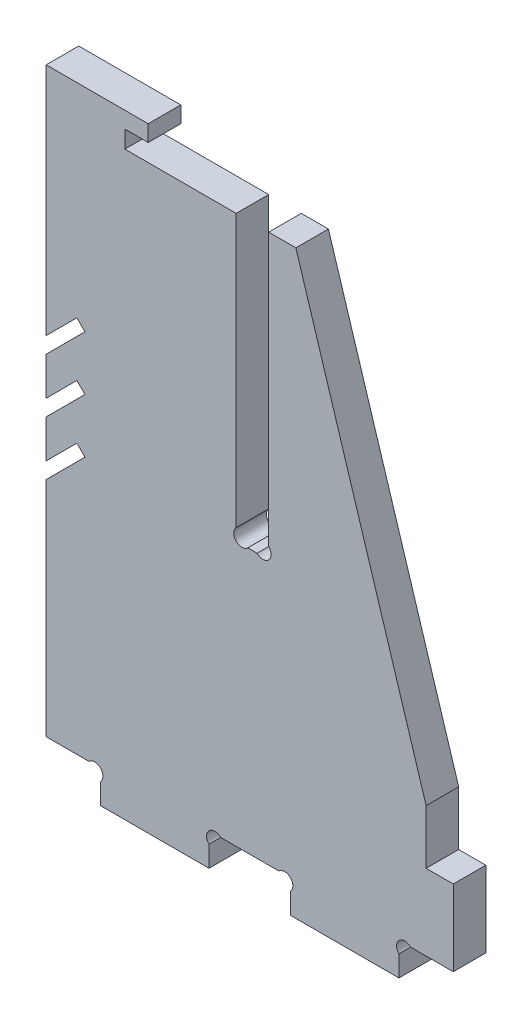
ISO-10303-21;
HEADER;
FILE_DESCRIPTION(('STEP AP214'),'2;1');
FILE_NAME('part.step','',(''),(''),'','','');
FILE_SCHEMA(('AUTOMOTIVE_DESIGN { 1 0 10303 214 1 1 1 1 }'));
ENDSEC;
DATA;
#1=APPLICATION_CONTEXT('core data for automotive mechanical design processes');
#2=APPLICATION_PROTOCOL_DEFINITION('international standard','automotive_design',2000,#1);
#3=PRODUCT_CONTEXT('',#1,'mechanical');
#4=PRODUCT('Part','Part','',(#3));
#5=PRODUCT_RELATED_PRODUCT_CATEGORY('part','',(#4));
#6=PRODUCT_DEFINITION_FORMATION('','',#4);
#7=PRODUCT_DEFINITION_CONTEXT('part definition',#1,'design');
#8=PRODUCT_DEFINITION('design','',#6,#7);
#9=PRODUCT_DEFINITION_SHAPE('','',#8);
#10=(LENGTH_UNIT() NAMED_UNIT(*) SI_UNIT(.MILLI.,.METRE.));
#11=(NAMED_UNIT(*) PLANE_ANGLE_UNIT() SI_UNIT($,.RADIAN.));
#12=(NAMED_UNIT(*) SI_UNIT($,.STERADIAN.) SOLID_ANGLE_UNIT());
#13=UNCERTAINTY_MEASURE_WITH_UNIT(LENGTH_MEASURE(1.E-05),#10,'distance_accuracy_value','');
#14=(GEOMETRIC_REPRESENTATION_CONTEXT(3) GLOBAL_UNCERTAINTY_ASSIGNED_CONTEXT((#13)) GLOBAL_UNIT_ASSIGNED_CONTEXT((#10,
#11,#12)) REPRESENTATION_CONTEXT('',''));
#15=CARTESIAN_POINT('',(0.,0.,0.));
#16=DIRECTION('',(0.,0.,1.));
#17=DIRECTION('',(1.,0.,0.));
#18=AXIS2_PLACEMENT_3D('',#15,#16,#17);
#19=CARTESIAN_POINT('',(46.,107.,6.));
#20=DIRECTION('',(-0.954700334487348,-0.297568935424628,0.));
#21=DIRECTION('',(0.297568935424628,-0.954700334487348,0.));
#22=AXIS2_PLACEMENT_3D('',#19,#20,#21);
#23=PLANE('',#22);
#24=DIRECTION('',(-0.297568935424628,0.954700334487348,0.));
#25=VECTOR('',#24,1.);
#26=CARTESIAN_POINT('',(46.,107.,0.));
#27=LINE('',#26,#25);
#28=CARTESIAN_POINT('',(70.,30.,0.));
#29=VERTEX_POINT('',#28);
#30=CARTESIAN_POINT('',(46.,107.,0.));
#31=VERTEX_POINT('',#30);
#32=EDGE_CURVE('E292',#29,#31,#27,.T.);
#33=ORIENTED_EDGE('',*,*,#32,.T.);
#34=DIRECTION('',(0.,0.,-1.));
#35=VECTOR('',#34,1.);
#36=CARTESIAN_POINT('',(46.,107.,6.));
#37=LINE('',#36,#35);
#38=CARTESIAN_POINT('',(46.,107.,6.));
#39=VERTEX_POINT('',#38);
#40=EDGE_CURVE('E11',#39,#31,#37,.T.);
#41=ORIENTED_EDGE('',*,*,#40,.F.);
#42=DIRECTION('',(-0.297568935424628,0.954700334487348,0.));
#43=VECTOR('',#42,1.);
#44=CARTESIAN_POINT('',(46.,107.,6.));
#45=LINE('',#44,#43);
#46=CARTESIAN_POINT('',(70.,30.,6.));
#47=VERTEX_POINT('',#46);
#48=EDGE_CURVE('E385',#47,#39,#45,.T.);
#49=ORIENTED_EDGE('',*,*,#48,.F.);
#50=DIRECTION('',(0.,0.,-1.));
#51=VECTOR('',#50,1.);
#52=CARTESIAN_POINT('',(70.,30.,6.));
#53=LINE('',#52,#51);
#54=EDGE_CURVE('E305',#47,#29,#53,.T.);
#55=ORIENTED_EDGE('',*,*,#54,.T.);
#56=EDGE_LOOP('',(#33,#41,#49,#55));
#57=FACE_BOUND('',#56,.T.);
#58=ADVANCED_FACE('F26',(#57),#23,.F.);
#59=CARTESIAN_POINT('',(41.,107.,6.));
#60=DIRECTION('',(0.,-1.,0.));
#61=DIRECTION('',(0.,0.,-1.));
#62=AXIS2_PLACEMENT_3D('',#59,#60,#61);
#63=PLANE('',#62);
#64=DIRECTION('',(-1.,0.,0.));
#65=VECTOR('',#64,1.);
#66=CARTESIAN_POINT('',(41.,107.,0.));
#67=LINE('',#66,#65);
#68=CARTESIAN_POINT('',(41.,107.,0.));
#69=VERTEX_POINT('',#68);
#70=EDGE_CURVE('E288',#31,#69,#67,.T.);
#71=ORIENTED_EDGE('',*,*,#70,.T.);
#72=DIRECTION('',(0.,0.,-1.));
#73=VECTOR('',#72,1.);
#74=CARTESIAN_POINT('',(41.,107.,6.));
#75=LINE('',#74,#73);
#76=CARTESIAN_POINT('',(41.,107.,6.));
#77=VERTEX_POINT('',#76);
#78=EDGE_CURVE('E33',#77,#69,#75,.T.);
#79=ORIENTED_EDGE('',*,*,#78,.F.);
#80=DIRECTION('',(-1.,0.,0.));
#81=VECTOR('',#80,1.);
#82=CARTESIAN_POINT('',(41.,107.,6.));
#83=LINE('',#82,#81);
#84=EDGE_CURVE('E301',#39,#77,#83,.T.);
#85=ORIENTED_EDGE('',*,*,#84,.F.);
#86=ORIENTED_EDGE('',*,*,#40,.T.);
#87=EDGE_LOOP('',(#71,#79,#85,#86));
#88=FACE_BOUND('',#87,.T.);
#89=ADVANCED_FACE('F300',(#88),#63,.F.);
#90=CARTESIAN_POINT('',(41.,107.,6.));
#91=DIRECTION('',(1.,0.,0.));
#92=DIRECTION('',(0.,1.,0.));
#93=AXIS2_PLACEMENT_3D('',#90,#91,#92);
#94=PLANE('',#93);
#95=DIRECTION('',(0.,-1.,0.));
#96=VECTOR('',#95,1.);
#97=CARTESIAN_POINT('',(41.,107.,0.));
#98=LINE('',#97,#96);
#99=CARTESIAN_POINT('',(41.,56.8496046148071,0.));
#100=VERTEX_POINT('',#99);
#101=EDGE_CURVE('E294',#69,#100,#98,.T.);
#102=ORIENTED_EDGE('',*,*,#101,.T.);
#103=DIRECTION('',(0.,0.,-1.));
#104=VECTOR('',#103,1.);
#105=CARTESIAN_POINT('',(41.,56.8496046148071,6.));
#106=LINE('',#105,#104);
#107=CARTESIAN_POINT('',(41.,56.8496046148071,6.));
#108=VERTEX_POINT('',#107);
#109=EDGE_CURVE('E576',#108,#100,#106,.T.);
#110=ORIENTED_EDGE('',*,*,#109,.F.);
#111=DIRECTION('',(0.,-1.,0.));
#112=VECTOR('',#111,1.);
#113=CARTESIAN_POINT('',(41.,107.,6.));
#114=LINE('',#113,#112);
#115=EDGE_CURVE('E388',#77,#108,#114,.T.);
#116=ORIENTED_EDGE('',*,*,#115,.F.);
#117=ORIENTED_EDGE('',*,*,#78,.T.);
#118=EDGE_LOOP('',(#102,#110,#116,#117));
#119=FACE_BOUND('',#118,.T.);
#120=ADVANCED_FACE('F580',(#119),#94,.F.);
#121=CARTESIAN_POINT('',(39.9251976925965,55.7748023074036,6.));
#122=DIRECTION('',(0.,0.,-1.));
#123=DIRECTION('',(-1.,0.,0.));
#124=AXIS2_PLACEMENT_3D('',#121,#122,#123);
#125=CYLINDRICAL_SURFACE('',#124,1.52);
#126=CARTESIAN_POINT('',(39.9251976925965,55.7748023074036,0.));
#127=DIRECTION('',(0.,0.,-1.));
#128=DIRECTION('',(-1.,0.,0.));
#129=AXIS2_PLACEMENT_3D('',#126,#127,#128);
#130=CIRCLE('',#129,1.52);
#131=CARTESIAN_POINT('',(38.8503953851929,54.7,0.));
#132=VERTEX_POINT('',#131);
#133=EDGE_CURVE('E309',#100,#132,#130,.T.);
#134=ORIENTED_EDGE('',*,*,#133,.T.);
#135=DIRECTION('',(0.,0.,-1.));
#136=VECTOR('',#135,1.);
#137=CARTESIAN_POINT('',(38.8503953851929,54.7,6.));
#138=LINE('',#137,#136);
#139=CARTESIAN_POINT('',(38.8503953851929,54.7,6.));
#140=VERTEX_POINT('',#139);
#141=EDGE_CURVE('E573',#140,#132,#138,.T.);
#142=ORIENTED_EDGE('',*,*,#141,.F.);
#143=CARTESIAN_POINT('',(39.9251976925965,55.7748023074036,6.));
#144=DIRECTION('',(0.,0.,-1.));
#145=DIRECTION('',(-1.,0.,0.));
#146=AXIS2_PLACEMENT_3D('',#143,#144,#145);
#147=CIRCLE('',#146,1.52);
#148=EDGE_CURVE('E390',#108,#140,#147,.T.);
#149=ORIENTED_EDGE('',*,*,#148,.F.);
#150=ORIENTED_EDGE('',*,*,#109,.T.);
#151=EDGE_LOOP('',(#134,#142,#149,#150));
#152=FACE_BOUND('',#151,.T.);
#153=ADVANCED_FACE('F588',(#152),#125,.F.);
#154=CARTESIAN_POINT('',(37.1496046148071,54.7,6.));
#155=DIRECTION('',(0.,-1.,0.));
#156=DIRECTION('',(1.,0.,0.));
#157=AXIS2_PLACEMENT_3D('',#154,#155,#156);
#158=PLANE('',#157);
#159=DIRECTION('',(-1.,0.,0.));
#160=VECTOR('',#159,1.);
#161=CARTESIAN_POINT('',(37.1496046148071,54.7,0.));
#162=LINE('',#161,#160);
#163=CARTESIAN_POINT('',(37.1496046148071,54.7,0.));
#164=VERTEX_POINT('',#163);
#165=EDGE_CURVE('E311',#132,#164,#162,.T.);
#166=ORIENTED_EDGE('',*,*,#165,.T.);
#167=DIRECTION('',(0.,0.,-1.));
#168=VECTOR('',#167,1.);
#169=CARTESIAN_POINT('',(37.1496046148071,54.7,6.));
#170=LINE('',#169,#168);
#171=CARTESIAN_POINT('',(37.1496046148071,54.7,6.));
#172=VERTEX_POINT('',#171);
#173=EDGE_CURVE('E570',#172,#164,#170,.T.);
#174=ORIENTED_EDGE('',*,*,#173,.F.);
#175=DIRECTION('',(-1.,0.,0.));
#176=VECTOR('',#175,1.);
#177=CARTESIAN_POINT('',(37.1496046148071,54.7,6.));
#178=LINE('',#177,#176);
#179=EDGE_CURVE('E392',#140,#172,#178,.T.);
#180=ORIENTED_EDGE('',*,*,#179,.F.);
#181=ORIENTED_EDGE('',*,*,#141,.T.);
#182=EDGE_LOOP('',(#166,#174,#180,#181));
#183=FACE_BOUND('',#182,.T.);
#184=ADVANCED_FACE('F591',(#183),#158,.F.);
#185=CARTESIAN_POINT('',(36.0748023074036,55.7748023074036,6.));
#186=DIRECTION('',(0.,0.,-1.));
#187=DIRECTION('',(-1.,0.,0.));
#188=AXIS2_PLACEMENT_3D('',#185,#186,#187);
#189=CYLINDRICAL_SURFACE('',#188,1.52);
#190=CARTESIAN_POINT('',(36.0748023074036,55.7748023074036,0.));
#191=DIRECTION('',(0.,0.,-1.));
#192=DIRECTION('',(1.,0.,0.));
#193=AXIS2_PLACEMENT_3D('',#190,#191,#192);
#194=CIRCLE('',#193,1.52);
#195=CARTESIAN_POINT('',(35.,56.8496046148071,0.));
#196=VERTEX_POINT('',#195);
#197=EDGE_CURVE('E313',#164,#196,#194,.T.);
#198=ORIENTED_EDGE('',*,*,#197,.T.);
#199=DIRECTION('',(0.,0.,-1.));
#200=VECTOR('',#199,1.);
#201=CARTESIAN_POINT('',(35.,56.8496046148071,6.));
#202=LINE('',#201,#200);
#203=CARTESIAN_POINT('',(35.,56.8496046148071,6.));
#204=VERTEX_POINT('',#203);
#205=EDGE_CURVE('E567',#204,#196,#202,.T.);
#206=ORIENTED_EDGE('',*,*,#205,.F.);
#207=CARTESIAN_POINT('',(36.0748023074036,55.7748023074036,6.));
#208=DIRECTION('',(0.,0.,-1.));
#209=DIRECTION('',(1.,0.,0.));
#210=AXIS2_PLACEMENT_3D('',#207,#208,#209);
#211=CIRCLE('',#210,1.52);
#212=EDGE_CURVE('E394',#172,#204,#211,.T.);
#213=ORIENTED_EDGE('',*,*,#212,.F.);
#214=ORIENTED_EDGE('',*,*,#173,.T.);
#215=EDGE_LOOP('',(#198,#206,#213,#214));
#216=FACE_BOUND('',#215,.T.);
#217=ADVANCED_FACE('F596',(#216),#189,.F.);
#218=CARTESIAN_POINT('',(35.,107.,6.));
#219=DIRECTION('',(-1.,0.,0.));
#220=DIRECTION('',(0.,0.,1.));
#221=AXIS2_PLACEMENT_3D('',#218,#219,#220);
#222=PLANE('',#221);
#223=DIRECTION('',(0.,1.,0.));
#224=VECTOR('',#223,1.);
#225=CARTESIAN_POINT('',(35.,107.,0.));
#226=LINE('',#225,#224);
#227=CARTESIAN_POINT('',(35.,107.,0.));
#228=VERTEX_POINT('',#227);
#229=EDGE_CURVE('E315',#196,#228,#226,.T.);
#230=ORIENTED_EDGE('',*,*,#229,.T.);
#231=DIRECTION('',(0.,0.,-1.));
#232=VECTOR('',#231,1.);
#233=CARTESIAN_POINT('',(35.,107.,6.));
#234=LINE('',#233,#232);
#235=CARTESIAN_POINT('',(35.,107.,6.));
#236=VERTEX_POINT('',#235);
#237=EDGE_CURVE('E564',#236,#228,#234,.T.);
#238=ORIENTED_EDGE('',*,*,#237,.F.);
#239=DIRECTION('',(0.,1.,0.));
#240=VECTOR('',#239,1.);
#241=CARTESIAN_POINT('',(35.,107.,6.));
#242=LINE('',#241,#240);
#243=EDGE_CURVE('E396',#204,#236,#242,.T.);
#244=ORIENTED_EDGE('',*,*,#243,.F.);
#245=ORIENTED_EDGE('',*,*,#205,.T.);
#246=EDGE_LOOP('',(#230,#238,#244,#245));
#247=FACE_BOUND('',#246,.T.);
#248=ADVANCED_FACE('F602',(#247),#222,.F.);
#249=CARTESIAN_POINT('',(14.5,107.,6.));
#250=DIRECTION('',(0.,-1.,0.));
#251=DIRECTION('',(0.,0.,-1.));
#252=AXIS2_PLACEMENT_3D('',#249,#250,#251);
#253=PLANE('',#252);
#254=DIRECTION('',(-1.,0.,0.));
#255=VECTOR('',#254,1.);
#256=CARTESIAN_POINT('',(14.5,107.,0.));
#257=LINE('',#256,#255);
#258=CARTESIAN_POINT('',(14.5,107.,0.));
#259=VERTEX_POINT('',#258);
#260=EDGE_CURVE('E317',#228,#259,#257,.T.);
#261=ORIENTED_EDGE('',*,*,#260,.T.);
#262=DIRECTION('',(0.,0.,-1.));
#263=VECTOR('',#262,1.);
#264=CARTESIAN_POINT('',(14.5,107.,6.));
#265=LINE('',#264,#263);
#266=CARTESIAN_POINT('',(14.5,107.,6.));
#267=VERTEX_POINT('',#266);
#268=EDGE_CURVE('E561',#267,#259,#265,.T.);
#269=ORIENTED_EDGE('',*,*,#268,.F.);
#270=DIRECTION('',(-1.,0.,0.));
#271=VECTOR('',#270,1.);
#272=CARTESIAN_POINT('',(14.5,107.,6.));
#273=LINE('',#272,#271);
#274=EDGE_CURVE('E398',#236,#267,#273,.T.);
#275=ORIENTED_EDGE('',*,*,#274,.F.);
#276=ORIENTED_EDGE('',*,*,#237,.T.);
#277=EDGE_LOOP('',(#261,#269,#275,#276));
#278=FACE_BOUND('',#277,.T.);
#279=ADVANCED_FACE('F606',(#278),#253,.F.);
#280=CARTESIAN_POINT('',(14.5,110.2,6.));
#281=DIRECTION('',(-1.,0.,0.));
#282=DIRECTION('',(0.,0.,1.));
#283=AXIS2_PLACEMENT_3D('',#280,#281,#282);
#284=PLANE('',#283);
#285=DIRECTION('',(0.,1.,0.));
#286=VECTOR('',#285,1.);
#287=CARTESIAN_POINT('',(14.5,110.2,0.));
#288=LINE('',#287,#286);
#289=CARTESIAN_POINT('',(14.5,110.2,0.));
#290=VERTEX_POINT('',#289);
#291=EDGE_CURVE('E319',#259,#290,#288,.T.);
#292=ORIENTED_EDGE('',*,*,#291,.T.);
#293=DIRECTION('',(0.,0.,-1.));
#294=VECTOR('',#293,1.);
#295=CARTESIAN_POINT('',(14.5,110.2,6.));
#296=LINE('',#295,#294);
#297=CARTESIAN_POINT('',(14.5,110.2,6.));
#298=VERTEX_POINT('',#297);
#299=EDGE_CURVE('E558',#298,#290,#296,.T.);
#300=ORIENTED_EDGE('',*,*,#299,.F.);
#301=DIRECTION('',(0.,1.,0.));
#302=VECTOR('',#301,1.);
#303=CARTESIAN_POINT('',(14.5,110.2,6.));
#304=LINE('',#303,#302);
#305=EDGE_CURVE('E400',#267,#298,#304,.T.);
#306=ORIENTED_EDGE('',*,*,#305,.F.);
#307=ORIENTED_EDGE('',*,*,#268,.T.);
#308=EDGE_LOOP('',(#292,#300,#306,#307));
#309=FACE_BOUND('',#308,.T.);
#310=ADVANCED_FACE('F611',(#309),#284,.F.);
#311=CARTESIAN_POINT('',(18.8,110.2,6.));
#312=DIRECTION('',(0.,1.,0.));
#313=DIRECTION('',(0.,0.,1.));
#314=AXIS2_PLACEMENT_3D('',#311,#312,#313);
#315=PLANE('',#314);
#316=DIRECTION('',(1.,0.,0.));
#317=VECTOR('',#316,1.);
#318=CARTESIAN_POINT('',(18.8,110.2,0.));
#319=LINE('',#318,#317);
#320=CARTESIAN_POINT('',(18.8,110.2,0.));
#321=VERTEX_POINT('',#320);
#322=EDGE_CURVE('E321',#290,#321,#319,.T.);
#323=ORIENTED_EDGE('',*,*,#322,.T.);
#324=DIRECTION('',(0.,0.,-1.));
#325=VECTOR('',#324,1.);
#326=CARTESIAN_POINT('',(18.8,110.2,6.));
#327=LINE('',#326,#325);
#328=CARTESIAN_POINT('',(18.8,110.2,6.));
#329=VERTEX_POINT('',#328);
#330=EDGE_CURVE('E555',#329,#321,#327,.T.);
#331=ORIENTED_EDGE('',*,*,#330,.F.);
#332=DIRECTION('',(1.,0.,0.));
#333=VECTOR('',#332,1.);
#334=CARTESIAN_POINT('',(18.8,110.2,6.));
#335=LINE('',#334,#333);
#336=EDGE_CURVE('E402',#298,#329,#335,.T.);
#337=ORIENTED_EDGE('',*,*,#336,.F.);
#338=ORIENTED_EDGE('',*,*,#299,.T.);
#339=EDGE_LOOP('',(#323,#331,#337,#338));
#340=FACE_BOUND('',#339,.T.);
#341=ADVANCED_FACE('F617',(#340),#315,.F.);
#342=CARTESIAN_POINT('',(18.8,113.2,6.));
#343=DIRECTION('',(-1.,0.,0.));
#344=DIRECTION('',(0.,0.,1.));
#345=AXIS2_PLACEMENT_3D('',#342,#343,#344);
#346=PLANE('',#345);
#347=DIRECTION('',(0.,1.,0.));
#348=VECTOR('',#347,1.);
#349=CARTESIAN_POINT('',(18.8,113.2,0.));
#350=LINE('',#349,#348);
#351=CARTESIAN_POINT('',(18.8,113.2,0.));
#352=VERTEX_POINT('',#351);
#353=EDGE_CURVE('E323',#321,#352,#350,.T.);
#354=ORIENTED_EDGE('',*,*,#353,.T.);
#355=DIRECTION('',(0.,0.,-1.));
#356=VECTOR('',#355,1.);
#357=CARTESIAN_POINT('',(18.8,113.2,6.));
#358=LINE('',#357,#356);
#359=CARTESIAN_POINT('',(18.8,113.2,6.));
#360=VERTEX_POINT('',#359);
#361=EDGE_CURVE('E552',#360,#352,#358,.T.);
#362=ORIENTED_EDGE('',*,*,#361,.F.);
#363=DIRECTION('',(0.,1.,0.));
#364=VECTOR('',#363,1.);
#365=CARTESIAN_POINT('',(18.8,113.2,6.));
#366=LINE('',#365,#364);
#367=EDGE_CURVE('E404',#329,#360,#366,.T.);
#368=ORIENTED_EDGE('',*,*,#367,.F.);
#369=ORIENTED_EDGE('',*,*,#330,.T.);
#370=EDGE_LOOP('',(#354,#362,#368,#369));
#371=FACE_BOUND('',#370,.T.);
#372=ADVANCED_FACE('F621',(#371),#346,.F.);
#373=CARTESIAN_POINT('',(0.,113.2,6.));
#374=DIRECTION('',(0.,-1.,0.));
#375=DIRECTION('',(0.,0.,-1.));
#376=AXIS2_PLACEMENT_3D('',#373,#374,#375);
#377=PLANE('',#376);
#378=DIRECTION('',(-1.,0.,0.));
#379=VECTOR('',#378,1.);
#380=CARTESIAN_POINT('',(0.,113.2,0.));
#381=LINE('',#380,#379);
#382=CARTESIAN_POINT('',(0.,113.2,0.));
#383=VERTEX_POINT('',#382);
#384=EDGE_CURVE('E325',#352,#383,#381,.T.);
#385=ORIENTED_EDGE('',*,*,#384,.T.);
#386=DIRECTION('',(0.,0.,-1.));
#387=VECTOR('',#386,1.);
#388=CARTESIAN_POINT('',(0.,113.2,6.));
#389=LINE('',#388,#387);
#390=CARTESIAN_POINT('',(0.,113.2,6.));
#391=VERTEX_POINT('',#390);
#392=EDGE_CURVE('E549',#391,#383,#389,.T.);
#393=ORIENTED_EDGE('',*,*,#392,.F.);
#394=DIRECTION('',(-1.,0.,0.));
#395=VECTOR('',#394,1.);
#396=CARTESIAN_POINT('',(0.,113.2,6.));
#397=LINE('',#396,#395);
#398=EDGE_CURVE('E406',#360,#391,#397,.T.);
#399=ORIENTED_EDGE('',*,*,#398,.F.);
#400=ORIENTED_EDGE('',*,*,#361,.T.);
#401=EDGE_LOOP('',(#385,#393,#399,#400));
#402=FACE_BOUND('',#401,.T.);
#403=ADVANCED_FACE('F626',(#402),#377,.F.);
#404=CARTESIAN_POINT('',(0.,70.,6.));
#405=DIRECTION('',(1.,0.,0.));
#406=DIRECTION('',(0.,1.,0.));
#407=AXIS2_PLACEMENT_3D('',#404,#405,#406);
#408=PLANE('',#407);
#409=DIRECTION('',(0.,-1.,0.));
#410=VECTOR('',#409,1.);
#411=CARTESIAN_POINT('',(0.,70.,0.));
#412=LINE('',#411,#410);
#413=CARTESIAN_POINT('',(0.,70.,0.));
#414=VERTEX_POINT('',#413);
#415=EDGE_CURVE('E327',#383,#414,#412,.T.);
#416=ORIENTED_EDGE('',*,*,#415,.T.);
#417=DIRECTION('',(0.,0.,-1.));
#418=VECTOR('',#417,1.);
#419=CARTESIAN_POINT('',(0.,70.,6.));
#420=LINE('',#419,#418);
#421=CARTESIAN_POINT('',(0.,70.,6.));
#422=VERTEX_POINT('',#421);
#423=EDGE_CURVE('E546',#422,#414,#420,.T.);
#424=ORIENTED_EDGE('',*,*,#423,.F.);
#425=DIRECTION('',(0.,-1.,0.));
#426=VECTOR('',#425,1.);
#427=CARTESIAN_POINT('',(0.,70.,6.));
#428=LINE('',#427,#426);
#429=EDGE_CURVE('E408',#391,#422,#428,.T.);
#430=ORIENTED_EDGE('',*,*,#429,.F.);
#431=ORIENTED_EDGE('',*,*,#392,.T.);
#432=EDGE_LOOP('',(#416,#424,#430,#431));
#433=FACE_BOUND('',#432,.T.);
#434=ADVANCED_FACE('F632',(#433),#408,.F.);
#435=CARTESIAN_POINT('',(0.,70.,6.));
#436=DIRECTION('',(-0.707106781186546,0.707106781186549,0.));
#437=DIRECTION('',(-0.707106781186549,-0.707106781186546,0.));
#438=AXIS2_PLACEMENT_3D('',#435,#436,#437);
#439=PLANE('',#438);
#440=DIRECTION('',(0.707106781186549,0.707106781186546,0.));
#441=VECTOR('',#440,1.);
#442=CARTESIAN_POINT('',(0.,70.,0.));
#443=LINE('',#442,#441);
#444=CARTESIAN_POINT('',(5.65685424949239,75.6568542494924,0.));
#445=VERTEX_POINT('',#444);
#446=EDGE_CURVE('E329',#414,#445,#443,.T.);
#447=ORIENTED_EDGE('',*,*,#446,.T.);
#448=DIRECTION('',(0.,0.,-1.));
#449=VECTOR('',#448,1.);
#450=CARTESIAN_POINT('',(5.65685424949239,75.6568542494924,6.));
#451=LINE('',#450,#449);
#452=CARTESIAN_POINT('',(5.65685424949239,75.6568542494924,6.));
#453=VERTEX_POINT('',#452);
#454=EDGE_CURVE('E543',#453,#445,#451,.T.);
#455=ORIENTED_EDGE('',*,*,#454,.F.);
#456=DIRECTION('',(0.707106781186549,0.707106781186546,0.));
#457=VECTOR('',#456,1.);
#458=CARTESIAN_POINT('',(0.,70.,6.));
#459=LINE('',#458,#457);
#460=EDGE_CURVE('E410',#422,#453,#459,.T.);
#461=ORIENTED_EDGE('',*,*,#460,.F.);
#462=ORIENTED_EDGE('',*,*,#423,.T.);
#463=EDGE_LOOP('',(#447,#455,#461,#462));
#464=FACE_BOUND('',#463,.T.);
#465=ADVANCED_FACE('F636',(#464),#439,.F.);
#466=CARTESIAN_POINT('',(5.65685424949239,75.6568542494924,6.));
#467=DIRECTION('',(0.707106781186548,0.707106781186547,0.));
#468=DIRECTION('',(-0.707106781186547,0.707106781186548,0.));
#469=AXIS2_PLACEMENT_3D('',#466,#467,#468);
#470=PLANE('',#469);
#471=DIRECTION('',(0.707106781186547,-0.707106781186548,0.));
#472=VECTOR('',#471,1.);
#473=CARTESIAN_POINT('',(5.65685424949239,75.6568542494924,0.));
#474=LINE('',#473,#472);
#475=CARTESIAN_POINT('',(7.14177848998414,74.1719300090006,0.));
#476=VERTEX_POINT('',#475);
#477=EDGE_CURVE('E331',#445,#476,#474,.T.);
#478=ORIENTED_EDGE('',*,*,#477,.T.);
#479=DIRECTION('',(0.,0.,-1.));
#480=VECTOR('',#479,1.);
#481=CARTESIAN_POINT('',(7.14177848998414,74.1719300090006,6.));
#482=LINE('',#481,#480);
#483=CARTESIAN_POINT('',(7.14177848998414,74.1719300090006,6.));
#484=VERTEX_POINT('',#483);
#485=EDGE_CURVE('E540',#484,#476,#482,.T.);
#486=ORIENTED_EDGE('',*,*,#485,.F.);
#487=DIRECTION('',(0.707106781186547,-0.707106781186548,0.));
#488=VECTOR('',#487,1.);
#489=CARTESIAN_POINT('',(5.65685424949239,75.6568542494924,6.));
#490=LINE('',#489,#488);
#491=EDGE_CURVE('E412',#453,#484,#490,.T.);
#492=ORIENTED_EDGE('',*,*,#491,.F.);
#493=ORIENTED_EDGE('',*,*,#454,.T.);
#494=EDGE_LOOP('',(#478,#486,#492,#493));
#495=FACE_BOUND('',#494,.T.);
#496=ADVANCED_FACE('F641',(#495),#470,.F.);
#497=CARTESIAN_POINT('',(7.14177848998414,74.1719300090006,6.));
#498=DIRECTION('',(0.707106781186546,-0.707106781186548,0.));
#499=DIRECTION('',(0.707106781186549,0.707106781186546,0.));
#500=AXIS2_PLACEMENT_3D('',#497,#498,#499);
#501=PLANE('',#500);
#502=DIRECTION('',(-0.707106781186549,-0.707106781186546,0.));
#503=VECTOR('',#502,1.);
#504=CARTESIAN_POINT('',(7.14177848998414,74.1719300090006,0.));
#505=LINE('',#504,#503);
#506=CARTESIAN_POINT('',(0.,67.0301515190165,0.));
#507=VERTEX_POINT('',#506);
#508=EDGE_CURVE('E333',#476,#507,#505,.T.);
#509=ORIENTED_EDGE('',*,*,#508,.T.);
#510=DIRECTION('',(0.,0.,-1.));
#511=VECTOR('',#510,1.);
#512=CARTESIAN_POINT('',(0.,67.0301515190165,6.));
#513=LINE('',#512,#511);
#514=CARTESIAN_POINT('',(0.,67.0301515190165,6.));
#515=VERTEX_POINT('',#514);
#516=EDGE_CURVE('E537',#515,#507,#513,.T.);
#517=ORIENTED_EDGE('',*,*,#516,.F.);
#518=DIRECTION('',(-0.707106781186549,-0.707106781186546,0.));
#519=VECTOR('',#518,1.);
#520=CARTESIAN_POINT('',(7.14177848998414,74.1719300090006,6.));
#521=LINE('',#520,#519);
#522=EDGE_CURVE('E414',#484,#515,#521,.T.);
#523=ORIENTED_EDGE('',*,*,#522,.F.);
#524=ORIENTED_EDGE('',*,*,#485,.T.);
#525=EDGE_LOOP('',(#509,#517,#523,#524));
#526=FACE_BOUND('',#525,.T.);
#527=ADVANCED_FACE('F647',(#526),#501,.F.);
#528=CARTESIAN_POINT('',(1.04744500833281E-13,60.,6.));
#529=DIRECTION('',(1.,0.,0.));
#530=DIRECTION('',(0.,1.,0.));
#531=AXIS2_PLACEMENT_3D('',#528,#529,#530);
#532=PLANE('',#531);
#533=DIRECTION('',(0.,-1.,0.));
#534=VECTOR('',#533,1.);
#535=CARTESIAN_POINT('',(1.04744500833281E-13,60.,0.));
#536=LINE('',#535,#534);
#537=CARTESIAN_POINT('',(1.04744500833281E-13,60.,0.));
#538=VERTEX_POINT('',#537);
#539=EDGE_CURVE('E335',#507,#538,#536,.T.);
#540=ORIENTED_EDGE('',*,*,#539,.T.);
#541=DIRECTION('',(0.,0.,-1.));
#542=VECTOR('',#541,1.);
#543=CARTESIAN_POINT('',(1.04744500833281E-13,60.,6.));
#544=LINE('',#543,#542);
#545=CARTESIAN_POINT('',(1.04744500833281E-13,60.,6.));
#546=VERTEX_POINT('',#545);
#547=EDGE_CURVE('E534',#546,#538,#544,.T.);
#548=ORIENTED_EDGE('',*,*,#547,.F.);
#549=DIRECTION('',(0.,-1.,0.));
#550=VECTOR('',#549,1.);
#551=CARTESIAN_POINT('',(1.04744500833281E-13,60.,6.));
#552=LINE('',#551,#550);
#553=EDGE_CURVE('E416',#515,#546,#552,.T.);
#554=ORIENTED_EDGE('',*,*,#553,.F.);
#555=ORIENTED_EDGE('',*,*,#516,.T.);
#556=EDGE_LOOP('',(#540,#548,#554,#555));
#557=FACE_BOUND('',#556,.T.);
#558=ADVANCED_FACE('F651',(#557),#532,.F.);
#559=CARTESIAN_POINT('',(1.04744500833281E-13,60.,6.));
#560=DIRECTION('',(-0.707106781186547,0.707106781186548,0.));
#561=DIRECTION('',(-0.707106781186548,-0.707106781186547,0.));
#562=AXIS2_PLACEMENT_3D('',#559,#560,#561);
#563=PLANE('',#562);
#564=DIRECTION('',(0.707106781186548,0.707106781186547,0.));
#565=VECTOR('',#564,1.);
#566=CARTESIAN_POINT('',(1.04744500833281E-13,60.,0.));
#567=LINE('',#566,#565);
#568=CARTESIAN_POINT('',(5.6568542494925,65.6568542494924,0.));
#569=VERTEX_POINT('',#568);
#570=EDGE_CURVE('E337',#538,#569,#567,.T.);
#571=ORIENTED_EDGE('',*,*,#570,.T.);
#572=DIRECTION('',(0.,0.,-1.));
#573=VECTOR('',#572,1.);
#574=CARTESIAN_POINT('',(5.6568542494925,65.6568542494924,6.));
#575=LINE('',#574,#573);
#576=CARTESIAN_POINT('',(5.6568542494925,65.6568542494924,6.));
#577=VERTEX_POINT('',#576);
#578=EDGE_CURVE('E531',#577,#569,#575,.T.);
#579=ORIENTED_EDGE('',*,*,#578,.F.);
#580=DIRECTION('',(0.707106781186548,0.707106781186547,0.));
#581=VECTOR('',#580,1.);
#582=CARTESIAN_POINT('',(1.04744500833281E-13,60.,6.));
#583=LINE('',#582,#581);
#584=EDGE_CURVE('E418',#546,#577,#583,.T.);
#585=ORIENTED_EDGE('',*,*,#584,.F.);
#586=ORIENTED_EDGE('',*,*,#547,.T.);
#587=EDGE_LOOP('',(#571,#579,#585,#586));
#588=FACE_BOUND('',#587,.T.);
#589=ADVANCED_FACE('F656',(#588),#563,.F.);
#590=CARTESIAN_POINT('',(5.6568542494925,65.6568542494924,6.));
#591=DIRECTION('',(0.707106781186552,0.707106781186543,0.));
#592=DIRECTION('',(-0.707106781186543,0.707106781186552,0.));
#593=AXIS2_PLACEMENT_3D('',#590,#591,#592);
#594=PLANE('',#593);
#595=DIRECTION('',(0.707106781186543,-0.707106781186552,0.));
#596=VECTOR('',#595,1.);
#597=CARTESIAN_POINT('',(5.6568542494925,65.6568542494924,0.));
#598=LINE('',#597,#596);
#599=CARTESIAN_POINT('',(7.14177848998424,64.1719300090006,0.));
#600=VERTEX_POINT('',#599);
#601=EDGE_CURVE('E339',#569,#600,#598,.T.);
#602=ORIENTED_EDGE('',*,*,#601,.T.);
#603=DIRECTION('',(0.,0.,-1.));
#604=VECTOR('',#603,1.);
#605=CARTESIAN_POINT('',(7.14177848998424,64.1719300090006,6.));
#606=LINE('',#605,#604);
#607=CARTESIAN_POINT('',(7.14177848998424,64.1719300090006,6.));
#608=VERTEX_POINT('',#607);
#609=EDGE_CURVE('E528',#608,#600,#606,.T.);
#610=ORIENTED_EDGE('',*,*,#609,.F.);
#611=DIRECTION('',(0.707106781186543,-0.707106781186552,0.));
#612=VECTOR('',#611,1.);
#613=CARTESIAN_POINT('',(5.6568542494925,65.6568542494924,6.));
#614=LINE('',#613,#612);
#615=EDGE_CURVE('E420',#577,#608,#614,.T.);
#616=ORIENTED_EDGE('',*,*,#615,.F.);
#617=ORIENTED_EDGE('',*,*,#578,.T.);
#618=EDGE_LOOP('',(#602,#610,#616,#617));
#619=FACE_BOUND('',#618,.T.);
#620=ADVANCED_FACE('F662',(#619),#594,.F.);
#621=CARTESIAN_POINT('',(7.14177848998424,64.1719300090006,6.));
#622=DIRECTION('',(0.707106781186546,-0.707106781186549,0.));
#623=DIRECTION('',(0.707106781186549,0.707106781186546,0.));
#624=AXIS2_PLACEMENT_3D('',#621,#622,#623);
#625=PLANE('',#624);
#626=DIRECTION('',(-0.707106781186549,-0.707106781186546,0.));
#627=VECTOR('',#626,1.);
#628=CARTESIAN_POINT('',(7.14177848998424,64.1719300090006,0.));
#629=LINE('',#628,#627);
#630=CARTESIAN_POINT('',(0.,57.0301515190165,0.));
#631=VERTEX_POINT('',#630);
#632=EDGE_CURVE('E341',#600,#631,#629,.T.);
#633=ORIENTED_EDGE('',*,*,#632,.T.);
#634=DIRECTION('',(0.,0.,-1.));
#635=VECTOR('',#634,1.);
#636=CARTESIAN_POINT('',(0.,57.0301515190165,6.));
#637=LINE('',#636,#635);
#638=CARTESIAN_POINT('',(0.,57.0301515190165,6.));
#639=VERTEX_POINT('',#638);
#640=EDGE_CURVE('E525',#639,#631,#637,.T.);
#641=ORIENTED_EDGE('',*,*,#640,.F.);
#642=DIRECTION('',(-0.707106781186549,-0.707106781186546,0.));
#643=VECTOR('',#642,1.);
#644=CARTESIAN_POINT('',(7.14177848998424,64.1719300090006,6.));
#645=LINE('',#644,#643);
#646=EDGE_CURVE('E422',#608,#639,#645,.T.);
#647=ORIENTED_EDGE('',*,*,#646,.F.);
#648=ORIENTED_EDGE('',*,*,#609,.T.);
#649=EDGE_LOOP('',(#633,#641,#647,#648));
#650=FACE_BOUND('',#649,.T.);
#651=ADVANCED_FACE('F666',(#650),#625,.F.);
#652=CARTESIAN_POINT('',(2.09489001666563E-13,50.,6.));
#653=DIRECTION('',(1.,0.,0.));
#654=DIRECTION('',(0.,1.,0.));
#655=AXIS2_PLACEMENT_3D('',#652,#653,#654);
#656=PLANE('',#655);
#657=DIRECTION('',(0.,-1.,0.));
#658=VECTOR('',#657,1.);
#659=CARTESIAN_POINT('',(2.09489001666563E-13,50.,0.));
#660=LINE('',#659,#658);
#661=CARTESIAN_POINT('',(2.09489001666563E-13,50.,0.));
#662=VERTEX_POINT('',#661);
#663=EDGE_CURVE('E343',#631,#662,#660,.T.);
#664=ORIENTED_EDGE('',*,*,#663,.T.);
#665=DIRECTION('',(0.,0.,-1.));
#666=VECTOR('',#665,1.);
#667=CARTESIAN_POINT('',(2.09489001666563E-13,50.,6.));
#668=LINE('',#667,#666);
#669=CARTESIAN_POINT('',(2.09489001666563E-13,50.,6.));
#670=VERTEX_POINT('',#669);
#671=EDGE_CURVE('E522',#670,#662,#668,.T.);
#672=ORIENTED_EDGE('',*,*,#671,.F.);
#673=DIRECTION('',(0.,-1.,0.));
#674=VECTOR('',#673,1.);
#675=CARTESIAN_POINT('',(2.09489001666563E-13,50.,6.));
#676=LINE('',#675,#674);
#677=EDGE_CURVE('E424',#639,#670,#676,.T.);
#678=ORIENTED_EDGE('',*,*,#677,.F.);
#679=ORIENTED_EDGE('',*,*,#640,.T.);
#680=EDGE_LOOP('',(#664,#672,#678,#679));
#681=FACE_BOUND('',#680,.T.);
#682=ADVANCED_FACE('F671',(#681),#656,.F.);
#683=CARTESIAN_POINT('',(2.09489001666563E-13,50.,6.));
#684=DIRECTION('',(-0.707106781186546,0.707106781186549,0.));
#685=DIRECTION('',(-0.707106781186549,-0.707106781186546,0.));
#686=AXIS2_PLACEMENT_3D('',#683,#684,#685);
#687=PLANE('',#686);
#688=DIRECTION('',(0.707106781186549,0.707106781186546,0.));
#689=VECTOR('',#688,1.);
#690=CARTESIAN_POINT('',(2.09489001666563E-13,50.,0.));
#691=LINE('',#690,#689);
#692=CARTESIAN_POINT('',(5.6568542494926,55.6568542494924,0.));
#693=VERTEX_POINT('',#692);
#694=EDGE_CURVE('E345',#662,#693,#691,.T.);
#695=ORIENTED_EDGE('',*,*,#694,.T.);
#696=DIRECTION('',(0.,0.,-1.));
#697=VECTOR('',#696,1.);
#698=CARTESIAN_POINT('',(5.6568542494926,55.6568542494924,6.));
#699=LINE('',#698,#697);
#700=CARTESIAN_POINT('',(5.6568542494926,55.6568542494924,6.));
#701=VERTEX_POINT('',#700);
#702=EDGE_CURVE('E519',#701,#693,#699,.T.);
#703=ORIENTED_EDGE('',*,*,#702,.F.);
#704=DIRECTION('',(0.707106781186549,0.707106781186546,0.));
#705=VECTOR('',#704,1.);
#706=CARTESIAN_POINT('',(2.09489001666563E-13,50.,6.));
#707=LINE('',#706,#705);
#708=EDGE_CURVE('E426',#670,#701,#707,.T.);
#709=ORIENTED_EDGE('',*,*,#708,.F.);
#710=ORIENTED_EDGE('',*,*,#671,.T.);
#711=EDGE_LOOP('',(#695,#703,#709,#710));
#712=FACE_BOUND('',#711,.T.);
#713=ADVANCED_FACE('F677',(#712),#687,.F.);
#714=CARTESIAN_POINT('',(5.6568542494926,55.6568542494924,6.));
#715=DIRECTION('',(0.707106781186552,0.707106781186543,0.));
#716=DIRECTION('',(-0.707106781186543,0.707106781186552,0.));
#717=AXIS2_PLACEMENT_3D('',#714,#715,#716);
#718=PLANE('',#717);
#719=DIRECTION('',(0.707106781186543,-0.707106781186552,0.));
#720=VECTOR('',#719,1.);
#721=CARTESIAN_POINT('',(5.6568542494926,55.6568542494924,0.));
#722=LINE('',#721,#720);
#723=CARTESIAN_POINT('',(7.14177848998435,54.1719300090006,0.));
#724=VERTEX_POINT('',#723);
#725=EDGE_CURVE('E347',#693,#724,#722,.T.);
#726=ORIENTED_EDGE('',*,*,#725,.T.);
#727=DIRECTION('',(0.,0.,-1.));
#728=VECTOR('',#727,1.);
#729=CARTESIAN_POINT('',(7.14177848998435,54.1719300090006,6.));
#730=LINE('',#729,#728);
#731=CARTESIAN_POINT('',(7.14177848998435,54.1719300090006,6.));
#732=VERTEX_POINT('',#731);
#733=EDGE_CURVE('E516',#732,#724,#730,.T.);
#734=ORIENTED_EDGE('',*,*,#733,.F.);
#735=DIRECTION('',(0.707106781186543,-0.707106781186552,0.));
#736=VECTOR('',#735,1.);
#737=CARTESIAN_POINT('',(5.6568542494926,55.6568542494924,6.));
#738=LINE('',#737,#736);
#739=EDGE_CURVE('E428',#701,#732,#738,.T.);
#740=ORIENTED_EDGE('',*,*,#739,.F.);
#741=ORIENTED_EDGE('',*,*,#702,.T.);
#742=EDGE_LOOP('',(#726,#734,#740,#741));
#743=FACE_BOUND('',#742,.T.);
#744=ADVANCED_FACE('F681',(#743),#718,.F.);
#745=CARTESIAN_POINT('',(7.14177848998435,54.1719300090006,6.));
#746=DIRECTION('',(0.707106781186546,-0.707106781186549,0.));
#747=DIRECTION('',(0.707106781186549,0.707106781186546,0.));
#748=AXIS2_PLACEMENT_3D('',#745,#746,#747);
#749=PLANE('',#748);
#750=DIRECTION('',(-0.707106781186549,-0.707106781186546,0.));
#751=VECTOR('',#750,1.);
#752=CARTESIAN_POINT('',(7.14177848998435,54.1719300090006,0.));
#753=LINE('',#752,#751);
#754=CARTESIAN_POINT('',(2.01682746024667E-13,47.0301515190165,0.));
#755=VERTEX_POINT('',#754);
#756=EDGE_CURVE('E349',#724,#755,#753,.T.);
#757=ORIENTED_EDGE('',*,*,#756,.T.);
#758=DIRECTION('',(0.,0.,-1.));
#759=VECTOR('',#758,1.);
#760=CARTESIAN_POINT('',(2.01682746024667E-13,47.0301515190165,6.));
#761=LINE('',#760,#759);
#762=CARTESIAN_POINT('',(2.01682746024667E-13,47.0301515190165,6.));
#763=VERTEX_POINT('',#762);
#764=EDGE_CURVE('E513',#763,#755,#761,.T.);
#765=ORIENTED_EDGE('',*,*,#764,.F.);
#766=DIRECTION('',(-0.707106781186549,-0.707106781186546,0.));
#767=VECTOR('',#766,1.);
#768=CARTESIAN_POINT('',(7.14177848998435,54.1719300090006,6.));
#769=LINE('',#768,#767);
#770=EDGE_CURVE('E430',#732,#763,#769,.T.);
#771=ORIENTED_EDGE('',*,*,#770,.F.);
#772=ORIENTED_EDGE('',*,*,#733,.T.);
#773=EDGE_LOOP('',(#757,#765,#771,#772));
#774=FACE_BOUND('',#773,.T.);
#775=ADVANCED_FACE('F686',(#774),#749,.F.);
#776=CARTESIAN_POINT('',(0.,5.99999999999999,6.));
#777=DIRECTION('',(1.,0.,0.));
#778=DIRECTION('',(0.,1.,0.));
#779=AXIS2_PLACEMENT_3D('',#776,#777,#778);
#780=PLANE('',#779);
#781=DIRECTION('',(0.,-1.,0.));
#782=VECTOR('',#781,1.);
#783=CARTESIAN_POINT('',(0.,5.99999999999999,0.));
#784=LINE('',#783,#782);
#785=CARTESIAN_POINT('',(0.,5.99999999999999,0.));
#786=VERTEX_POINT('',#785);
#787=EDGE_CURVE('E351',#755,#786,#784,.T.);
#788=ORIENTED_EDGE('',*,*,#787,.T.);
#789=DIRECTION('',(0.,0.,-1.));
#790=VECTOR('',#789,1.);
#791=CARTESIAN_POINT('',(0.,5.99999999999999,6.));
#792=LINE('',#791,#790);
#793=CARTESIAN_POINT('',(0.,5.99999999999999,6.));
#794=VERTEX_POINT('',#793);
#795=EDGE_CURVE('E510',#794,#786,#792,.T.);
#796=ORIENTED_EDGE('',*,*,#795,.F.);
#797=DIRECTION('',(0.,-1.,0.));
#798=VECTOR('',#797,1.);
#799=CARTESIAN_POINT('',(0.,5.99999999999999,6.));
#800=LINE('',#799,#798);
#801=EDGE_CURVE('E432',#763,#794,#800,.T.);
#802=ORIENTED_EDGE('',*,*,#801,.F.);
#803=ORIENTED_EDGE('',*,*,#764,.T.);
#804=EDGE_LOOP('',(#788,#796,#802,#803));
#805=FACE_BOUND('',#804,.T.);
#806=ADVANCED_FACE('F692',(#805),#780,.F.);
#807=CARTESIAN_POINT('',(7.85039538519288,6.,6.));
#808=DIRECTION('',(0.,1.,0.));
#809=DIRECTION('',(-1.,0.,0.));
#810=AXIS2_PLACEMENT_3D('',#807,#808,#809);
#811=PLANE('',#810);
#812=DIRECTION('',(1.,0.,0.));
#813=VECTOR('',#812,1.);
#814=CARTESIAN_POINT('',(7.85039538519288,6.,0.));
#815=LINE('',#814,#813);
#816=CARTESIAN_POINT('',(7.85039538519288,6.,0.));
#817=VERTEX_POINT('',#816);
#818=EDGE_CURVE('E353',#786,#817,#815,.T.);
#819=ORIENTED_EDGE('',*,*,#818,.T.);
#820=DIRECTION('',(0.,0.,-1.));
#821=VECTOR('',#820,1.);
#822=CARTESIAN_POINT('',(7.85039538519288,6.,6.));
#823=LINE('',#822,#821);
#824=CARTESIAN_POINT('',(7.85039538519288,6.,6.));
#825=VERTEX_POINT('',#824);
#826=EDGE_CURVE('E507',#825,#817,#823,.T.);
#827=ORIENTED_EDGE('',*,*,#826,.F.);
#828=DIRECTION('',(1.,0.,0.));
#829=VECTOR('',#828,1.);
#830=CARTESIAN_POINT('',(7.85039538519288,6.,6.));
#831=LINE('',#830,#829);
#832=EDGE_CURVE('E434',#794,#825,#831,.T.);
#833=ORIENTED_EDGE('',*,*,#832,.F.);
#834=ORIENTED_EDGE('',*,*,#795,.T.);
#835=EDGE_LOOP('',(#819,#827,#833,#834));
#836=FACE_BOUND('',#835,.T.);
#837=ADVANCED_FACE('F696',(#836),#811,.F.);
#838=CARTESIAN_POINT('',(8.92519769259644,4.92519769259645,6.));
#839=DIRECTION('',(0.,0.,-1.));
#840=DIRECTION('',(-1.,0.,0.));
#841=AXIS2_PLACEMENT_3D('',#838,#839,#840);
#842=CYLINDRICAL_SURFACE('',#841,1.52);
#843=CARTESIAN_POINT('',(8.92519769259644,4.92519769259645,0.));
#844=DIRECTION('',(0.,0.,-1.));
#845=DIRECTION('',(1.,0.,0.));
#846=AXIS2_PLACEMENT_3D('',#843,#844,#845);
#847=CIRCLE('',#846,1.52);
#848=CARTESIAN_POINT('',(9.99999999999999,3.85039538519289,0.));
#849=VERTEX_POINT('',#848);
#850=EDGE_CURVE('E355',#817,#849,#847,.T.);
#851=ORIENTED_EDGE('',*,*,#850,.T.);
#852=DIRECTION('',(0.,0.,-1.));
#853=VECTOR('',#852,1.);
#854=CARTESIAN_POINT('',(9.99999999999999,3.85039538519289,6.));
#855=LINE('',#854,#853);
#856=CARTESIAN_POINT('',(9.99999999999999,3.85039538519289,6.));
#857=VERTEX_POINT('',#856);
#858=EDGE_CURVE('E504',#857,#849,#855,.T.);
#859=ORIENTED_EDGE('',*,*,#858,.F.);
#860=CARTESIAN_POINT('',(8.92519769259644,4.92519769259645,6.));
#861=DIRECTION('',(0.,0.,-1.));
#862=DIRECTION('',(1.,0.,0.));
#863=AXIS2_PLACEMENT_3D('',#860,#861,#862);
#864=CIRCLE('',#863,1.52);
#865=EDGE_CURVE('E436',#825,#857,#864,.T.);
#866=ORIENTED_EDGE('',*,*,#865,.F.);
#867=ORIENTED_EDGE('',*,*,#826,.T.);
#868=EDGE_LOOP('',(#851,#859,#866,#867));
#869=FACE_BOUND('',#868,.T.);
#870=ADVANCED_FACE('F701',(#869),#842,.F.);
#871=CARTESIAN_POINT('',(9.99999999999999,3.85039538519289,6.));
#872=DIRECTION('',(1.,0.,0.));
#873=DIRECTION('',(0.,1.,0.));
#874=AXIS2_PLACEMENT_3D('',#871,#872,#873);
#875=PLANE('',#874);
#876=DIRECTION('',(0.,-1.,0.));
#877=VECTOR('',#876,1.);
#878=CARTESIAN_POINT('',(9.99999999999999,3.85039538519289,0.));
#879=LINE('',#878,#877);
#880=CARTESIAN_POINT('',(9.99999999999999,0.,0.));
#881=VERTEX_POINT('',#880);
#882=EDGE_CURVE('E357',#849,#881,#879,.T.);
#883=ORIENTED_EDGE('',*,*,#882,.T.);
#884=DIRECTION('',(0.,0.,-1.));
#885=VECTOR('',#884,1.);
#886=CARTESIAN_POINT('',(9.99999999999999,0.,6.));
#887=LINE('',#886,#885);
#888=CARTESIAN_POINT('',(9.99999999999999,0.,6.));
#889=VERTEX_POINT('',#888);
#890=EDGE_CURVE('E501',#889,#881,#887,.T.);
#891=ORIENTED_EDGE('',*,*,#890,.F.);
#892=DIRECTION('',(0.,-1.,0.));
#893=VECTOR('',#892,1.);
#894=CARTESIAN_POINT('',(9.99999999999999,3.85039538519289,6.));
#895=LINE('',#894,#893);
#896=EDGE_CURVE('E438',#857,#889,#895,.T.);
#897=ORIENTED_EDGE('',*,*,#896,.F.);
#898=ORIENTED_EDGE('',*,*,#858,.T.);
#899=EDGE_LOOP('',(#883,#891,#897,#898));
#900=FACE_BOUND('',#899,.T.);
#901=ADVANCED_FACE('F707',(#900),#875,.F.);
#902=CARTESIAN_POINT('',(9.99999999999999,0.,6.));
#903=DIRECTION('',(0.,1.,0.));
#904=DIRECTION('',(-1.,0.,0.));
#905=AXIS2_PLACEMENT_3D('',#902,#903,#904);
#906=PLANE('',#905);
#907=DIRECTION('',(1.,0.,0.));
#908=VECTOR('',#907,1.);
#909=CARTESIAN_POINT('',(9.99999999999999,0.,0.));
#910=LINE('',#909,#908);
#911=CARTESIAN_POINT('',(30.,0.,0.));
#912=VERTEX_POINT('',#911);
#913=EDGE_CURVE('E359',#881,#912,#910,.T.);
#914=ORIENTED_EDGE('',*,*,#913,.T.);
#915=DIRECTION('',(0.,0.,-1.));
#916=VECTOR('',#915,1.);
#917=CARTESIAN_POINT('',(30.,0.,6.));
#918=LINE('',#917,#916);
#919=CARTESIAN_POINT('',(30.,0.,6.));
#920=VERTEX_POINT('',#919);
#921=EDGE_CURVE('E498',#920,#912,#918,.T.);
#922=ORIENTED_EDGE('',*,*,#921,.F.);
#923=DIRECTION('',(1.,0.,0.));
#924=VECTOR('',#923,1.);
#925=CARTESIAN_POINT('',(9.99999999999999,0.,6.));
#926=LINE('',#925,#924);
#927=EDGE_CURVE('E440',#889,#920,#926,.T.);
#928=ORIENTED_EDGE('',*,*,#927,.F.);
#929=ORIENTED_EDGE('',*,*,#890,.T.);
#930=EDGE_LOOP('',(#914,#922,#928,#929));
#931=FACE_BOUND('',#930,.T.);
#932=ADVANCED_FACE('F711',(#931),#906,.F.);
#933=CARTESIAN_POINT('',(30.,0.,6.));
#934=DIRECTION('',(-1.,0.,0.));
#935=DIRECTION('',(0.,-1.,0.));
#936=AXIS2_PLACEMENT_3D('',#933,#934,#935);
#937=PLANE('',#936);
#938=DIRECTION('',(0.,1.,0.));
#939=VECTOR('',#938,1.);
#940=CARTESIAN_POINT('',(30.,0.,0.));
#941=LINE('',#940,#939);
#942=CARTESIAN_POINT('',(30.,3.85039538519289,0.));
#943=VERTEX_POINT('',#942);
#944=EDGE_CURVE('E361',#912,#943,#941,.T.);
#945=ORIENTED_EDGE('',*,*,#944,.T.);
#946=DIRECTION('',(0.,0.,-1.));
#947=VECTOR('',#946,1.);
#948=CARTESIAN_POINT('',(30.,3.85039538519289,6.));
#949=LINE('',#948,#947);
#950=CARTESIAN_POINT('',(30.,3.85039538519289,6.));
#951=VERTEX_POINT('',#950);
#952=EDGE_CURVE('E495',#951,#943,#949,.T.);
#953=ORIENTED_EDGE('',*,*,#952,.F.);
#954=DIRECTION('',(0.,1.,0.));
#955=VECTOR('',#954,1.);
#956=CARTESIAN_POINT('',(30.,0.,6.));
#957=LINE('',#956,#955);
#958=EDGE_CURVE('E442',#920,#951,#957,.T.);
#959=ORIENTED_EDGE('',*,*,#958,.F.);
#960=ORIENTED_EDGE('',*,*,#921,.T.);
#961=EDGE_LOOP('',(#945,#953,#959,#960));
#962=FACE_BOUND('',#961,.T.);
#963=ADVANCED_FACE('F716',(#962),#937,.F.);
#964=CARTESIAN_POINT('',(31.0748023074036,4.92519769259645,6.));
#965=DIRECTION('',(0.,0.,-1.));
#966=DIRECTION('',(-1.,0.,0.));
#967=AXIS2_PLACEMENT_3D('',#964,#965,#966);
#968=CYLINDRICAL_SURFACE('',#967,1.52);
#969=CARTESIAN_POINT('',(31.0748023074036,4.92519769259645,0.));
#970=DIRECTION('',(0.,0.,-1.));
#971=DIRECTION('',(-1.,0.,0.));
#972=AXIS2_PLACEMENT_3D('',#969,#970,#971);
#973=CIRCLE('',#972,1.52);
#974=CARTESIAN_POINT('',(32.1496046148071,6.,0.));
#975=VERTEX_POINT('',#974);
#976=EDGE_CURVE('E363',#943,#975,#973,.T.);
#977=ORIENTED_EDGE('',*,*,#976,.T.);
#978=DIRECTION('',(0.,0.,-1.));
#979=VECTOR('',#978,1.);
#980=CARTESIAN_POINT('',(32.1496046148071,6.,6.));
#981=LINE('',#980,#979);
#982=CARTESIAN_POINT('',(32.1496046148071,6.,6.));
#983=VERTEX_POINT('',#982);
#984=EDGE_CURVE('E492',#983,#975,#981,.T.);
#985=ORIENTED_EDGE('',*,*,#984,.F.);
#986=CARTESIAN_POINT('',(31.0748023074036,4.92519769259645,6.));
#987=DIRECTION('',(0.,0.,-1.));
#988=DIRECTION('',(-1.,0.,0.));
#989=AXIS2_PLACEMENT_3D('',#986,#987,#988);
#990=CIRCLE('',#989,1.52);
#991=EDGE_CURVE('E444',#951,#983,#990,.T.);
#992=ORIENTED_EDGE('',*,*,#991,.F.);
#993=ORIENTED_EDGE('',*,*,#952,.T.);
#994=EDGE_LOOP('',(#977,#985,#992,#993));
#995=FACE_BOUND('',#994,.T.);
#996=ADVANCED_FACE('F722',(#995),#968,.F.);
#997=CARTESIAN_POINT('',(32.1496046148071,6.,6.));
#998=DIRECTION('',(0.,1.,0.));
#999=DIRECTION('',(-1.,0.,0.));
#1000=AXIS2_PLACEMENT_3D('',#997,#998,#999);
#1001=PLANE('',#1000);
#1002=DIRECTION('',(1.,0.,0.));
#1003=VECTOR('',#1002,1.);
#1004=CARTESIAN_POINT('',(32.1496046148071,6.,0.));
#1005=LINE('',#1004,#1003);
#1006=CARTESIAN_POINT('',(42.8503953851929,6.,0.));
#1007=VERTEX_POINT('',#1006);
#1008=EDGE_CURVE('E365',#975,#1007,#1005,.T.);
#1009=ORIENTED_EDGE('',*,*,#1008,.T.);
#1010=DIRECTION('',(0.,0.,-1.));
#1011=VECTOR('',#1010,1.);
#1012=CARTESIAN_POINT('',(42.8503953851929,6.,6.));
#1013=LINE('',#1012,#1011);
#1014=CARTESIAN_POINT('',(42.8503953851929,6.,6.));
#1015=VERTEX_POINT('',#1014);
#1016=EDGE_CURVE('E489',#1015,#1007,#1013,.T.);
#1017=ORIENTED_EDGE('',*,*,#1016,.F.);
#1018=DIRECTION('',(1.,0.,0.));
#1019=VECTOR('',#1018,1.);
#1020=CARTESIAN_POINT('',(32.1496046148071,6.,6.));
#1021=LINE('',#1020,#1019);
#1022=EDGE_CURVE('E446',#983,#1015,#1021,.T.);
#1023=ORIENTED_EDGE('',*,*,#1022,.F.);
#1024=ORIENTED_EDGE('',*,*,#984,.T.);
#1025=EDGE_LOOP('',(#1009,#1017,#1023,#1024));
#1026=FACE_BOUND('',#1025,.T.);
#1027=ADVANCED_FACE('F726',(#1026),#1001,.F.);
#1028=CARTESIAN_POINT('',(43.9251976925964,4.92519769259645,6.));
#1029=DIRECTION('',(0.,0.,-1.));
#1030=DIRECTION('',(-1.,0.,0.));
#1031=AXIS2_PLACEMENT_3D('',#1028,#1029,#1030);
#1032=CYLINDRICAL_SURFACE('',#1031,1.52);
#1033=CARTESIAN_POINT('',(43.9251976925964,4.92519769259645,0.));
#1034=DIRECTION('',(0.,0.,-1.));
#1035=DIRECTION('',(1.,0.,0.));
#1036=AXIS2_PLACEMENT_3D('',#1033,#1034,#1035);
#1037=CIRCLE('',#1036,1.52);
#1038=CARTESIAN_POINT('',(45.,3.8503953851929,0.));
#1039=VERTEX_POINT('',#1038);
#1040=EDGE_CURVE('E367',#1007,#1039,#1037,.T.);
#1041=ORIENTED_EDGE('',*,*,#1040,.T.);
#1042=DIRECTION('',(0.,0.,-1.));
#1043=VECTOR('',#1042,1.);
#1044=CARTESIAN_POINT('',(45.,3.8503953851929,6.));
#1045=LINE('',#1044,#1043);
#1046=CARTESIAN_POINT('',(45.,3.8503953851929,6.));
#1047=VERTEX_POINT('',#1046);
#1048=EDGE_CURVE('E486',#1047,#1039,#1045,.T.);
#1049=ORIENTED_EDGE('',*,*,#1048,.F.);
#1050=CARTESIAN_POINT('',(43.9251976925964,4.92519769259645,6.));
#1051=DIRECTION('',(0.,0.,-1.));
#1052=DIRECTION('',(1.,0.,0.));
#1053=AXIS2_PLACEMENT_3D('',#1050,#1051,#1052);
#1054=CIRCLE('',#1053,1.52);
#1055=EDGE_CURVE('E448',#1015,#1047,#1054,.T.);
#1056=ORIENTED_EDGE('',*,*,#1055,.F.);
#1057=ORIENTED_EDGE('',*,*,#1016,.T.);
#1058=EDGE_LOOP('',(#1041,#1049,#1056,#1057));
#1059=FACE_BOUND('',#1058,.T.);
#1060=ADVANCED_FACE('F731',(#1059),#1032,.F.);
#1061=CARTESIAN_POINT('',(45.,0.,6.));
#1062=DIRECTION('',(1.,0.,0.));
#1063=DIRECTION('',(0.,0.,-1.));
#1064=AXIS2_PLACEMENT_3D('',#1061,#1062,#1063);
#1065=PLANE('',#1064);
#1066=DIRECTION('',(0.,-1.,0.));
#1067=VECTOR('',#1066,1.);
#1068=CARTESIAN_POINT('',(45.,0.,0.));
#1069=LINE('',#1068,#1067);
#1070=CARTESIAN_POINT('',(45.,0.,0.));
#1071=VERTEX_POINT('',#1070);
#1072=EDGE_CURVE('E369',#1039,#1071,#1069,.T.);
#1073=ORIENTED_EDGE('',*,*,#1072,.T.);
#1074=DIRECTION('',(0.,0.,-1.));
#1075=VECTOR('',#1074,1.);
#1076=CARTESIAN_POINT('',(45.,0.,6.));
#1077=LINE('',#1076,#1075);
#1078=CARTESIAN_POINT('',(45.,0.,6.));
#1079=VERTEX_POINT('',#1078);
#1080=EDGE_CURVE('E483',#1079,#1071,#1077,.T.);
#1081=ORIENTED_EDGE('',*,*,#1080,.F.);
#1082=DIRECTION('',(0.,-1.,0.));
#1083=VECTOR('',#1082,1.);
#1084=CARTESIAN_POINT('',(45.,0.,6.));
#1085=LINE('',#1084,#1083);
#1086=EDGE_CURVE('E450',#1047,#1079,#1085,.T.);
#1087=ORIENTED_EDGE('',*,*,#1086,.F.);
#1088=ORIENTED_EDGE('',*,*,#1048,.T.);
#1089=EDGE_LOOP('',(#1073,#1081,#1087,#1088));
#1090=FACE_BOUND('',#1089,.T.);
#1091=ADVANCED_FACE('F737',(#1090),#1065,.F.);
#1092=CARTESIAN_POINT('',(65.,0.,6.));
#1093=DIRECTION('',(0.,1.,0.));
#1094=DIRECTION('',(0.,0.,1.));
#1095=AXIS2_PLACEMENT_3D('',#1092,#1093,#1094);
#1096=PLANE('',#1095);
#1097=DIRECTION('',(1.,0.,0.));
#1098=VECTOR('',#1097,1.);
#1099=CARTESIAN_POINT('',(65.,0.,0.));
#1100=LINE('',#1099,#1098);
#1101=CARTESIAN_POINT('',(65.,0.,0.));
#1102=VERTEX_POINT('',#1101);
#1103=EDGE_CURVE('E371',#1071,#1102,#1100,.T.);
#1104=ORIENTED_EDGE('',*,*,#1103,.T.);
#1105=DIRECTION('',(0.,0.,-1.));
#1106=VECTOR('',#1105,1.);
#1107=CARTESIAN_POINT('',(65.,0.,6.));
#1108=LINE('',#1107,#1106);
#1109=CARTESIAN_POINT('',(65.,0.,6.));
#1110=VERTEX_POINT('',#1109);
#1111=EDGE_CURVE('E480',#1110,#1102,#1108,.T.);
#1112=ORIENTED_EDGE('',*,*,#1111,.F.);
#1113=DIRECTION('',(1.,0.,0.));
#1114=VECTOR('',#1113,1.);
#1115=CARTESIAN_POINT('',(65.,0.,6.));
#1116=LINE('',#1115,#1114);
#1117=EDGE_CURVE('E452',#1079,#1110,#1116,.T.);
#1118=ORIENTED_EDGE('',*,*,#1117,.F.);
#1119=ORIENTED_EDGE('',*,*,#1080,.T.);
#1120=EDGE_LOOP('',(#1104,#1112,#1118,#1119));
#1121=FACE_BOUND('',#1120,.T.);
#1122=ADVANCED_FACE('F741',(#1121),#1096,.F.);
#1123=CARTESIAN_POINT('',(65.,3.85039538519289,6.));
#1124=DIRECTION('',(-1.,0.,0.));
#1125=DIRECTION('',(0.,-1.,0.));
#1126=AXIS2_PLACEMENT_3D('',#1123,#1124,#1125);
#1127=PLANE('',#1126);
#1128=DIRECTION('',(0.,1.,0.));
#1129=VECTOR('',#1128,1.);
#1130=CARTESIAN_POINT('',(65.,3.85039538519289,0.));
#1131=LINE('',#1130,#1129);
#1132=CARTESIAN_POINT('',(65.,3.85039538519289,0.));
#1133=VERTEX_POINT('',#1132);
#1134=EDGE_CURVE('E373',#1102,#1133,#1131,.T.);
#1135=ORIENTED_EDGE('',*,*,#1134,.T.);
#1136=DIRECTION('',(0.,0.,-1.));
#1137=VECTOR('',#1136,1.);
#1138=CARTESIAN_POINT('',(65.,3.85039538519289,6.));
#1139=LINE('',#1138,#1137);
#1140=CARTESIAN_POINT('',(65.,3.85039538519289,6.));
#1141=VERTEX_POINT('',#1140);
#1142=EDGE_CURVE('E477',#1141,#1133,#1139,.T.);
#1143=ORIENTED_EDGE('',*,*,#1142,.F.);
#1144=DIRECTION('',(0.,1.,0.));
#1145=VECTOR('',#1144,1.);
#1146=CARTESIAN_POINT('',(65.,3.85039538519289,6.));
#1147=LINE('',#1146,#1145);
#1148=EDGE_CURVE('E454',#1110,#1141,#1147,.T.);
#1149=ORIENTED_EDGE('',*,*,#1148,.F.);
#1150=ORIENTED_EDGE('',*,*,#1111,.T.);
#1151=EDGE_LOOP('',(#1135,#1143,#1149,#1150));
#1152=FACE_BOUND('',#1151,.T.);
#1153=ADVANCED_FACE('F746',(#1152),#1127,.F.);
#1154=CARTESIAN_POINT('',(66.0748023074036,4.92519769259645,6.));
#1155=DIRECTION('',(0.,0.,-1.));
#1156=DIRECTION('',(-1.,0.,0.));
#1157=AXIS2_PLACEMENT_3D('',#1154,#1155,#1156);
#1158=CYLINDRICAL_SURFACE('',#1157,1.52000000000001);
#1159=CARTESIAN_POINT('',(66.0748023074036,4.92519769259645,0.));
#1160=DIRECTION('',(0.,0.,-1.));
#1161=DIRECTION('',(-1.,0.,0.));
#1162=AXIS2_PLACEMENT_3D('',#1159,#1160,#1161);
#1163=CIRCLE('',#1162,1.52000000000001);
#1164=CARTESIAN_POINT('',(67.1496046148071,6.,0.));
#1165=VERTEX_POINT('',#1164);
#1166=EDGE_CURVE('E375',#1133,#1165,#1163,.T.);
#1167=ORIENTED_EDGE('',*,*,#1166,.T.);
#1168=DIRECTION('',(0.,0.,-1.));
#1169=VECTOR('',#1168,1.);
#1170=CARTESIAN_POINT('',(67.1496046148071,6.,6.));
#1171=LINE('',#1170,#1169);
#1172=CARTESIAN_POINT('',(67.1496046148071,6.,6.));
#1173=VERTEX_POINT('',#1172);
#1174=EDGE_CURVE('E474',#1173,#1165,#1171,.T.);
#1175=ORIENTED_EDGE('',*,*,#1174,.F.);
#1176=CARTESIAN_POINT('',(66.0748023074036,4.92519769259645,6.));
#1177=DIRECTION('',(0.,0.,-1.));
#1178=DIRECTION('',(-1.,0.,0.));
#1179=AXIS2_PLACEMENT_3D('',#1176,#1177,#1178);
#1180=CIRCLE('',#1179,1.52000000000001);
#1181=EDGE_CURVE('E456',#1141,#1173,#1180,.T.);
#1182=ORIENTED_EDGE('',*,*,#1181,.F.);
#1183=ORIENTED_EDGE('',*,*,#1142,.T.);
#1184=EDGE_LOOP('',(#1167,#1175,#1182,#1183));
#1185=FACE_BOUND('',#1184,.T.);
#1186=ADVANCED_FACE('F752',(#1185),#1158,.F.);
#1187=CARTESIAN_POINT('',(67.1496046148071,6.,6.));
#1188=DIRECTION('',(0.,1.,0.));
#1189=DIRECTION('',(-1.,0.,0.));
#1190=AXIS2_PLACEMENT_3D('',#1187,#1188,#1189);
#1191=PLANE('',#1190);
#1192=DIRECTION('',(1.,0.,0.));
#1193=VECTOR('',#1192,1.);
#1194=CARTESIAN_POINT('',(67.1496046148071,6.,0.));
#1195=LINE('',#1194,#1193);
#1196=CARTESIAN_POINT('',(75.,6.00000000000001,0.));
#1197=VERTEX_POINT('',#1196);
#1198=EDGE_CURVE('E377',#1165,#1197,#1195,.T.);
#1199=ORIENTED_EDGE('',*,*,#1198,.T.);
#1200=DIRECTION('',(0.,0.,-1.));
#1201=VECTOR('',#1200,1.);
#1202=CARTESIAN_POINT('',(75.,6.00000000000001,6.));
#1203=LINE('',#1202,#1201);
#1204=CARTESIAN_POINT('',(75.,6.00000000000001,6.));
#1205=VERTEX_POINT('',#1204);
#1206=EDGE_CURVE('E471',#1205,#1197,#1203,.T.);
#1207=ORIENTED_EDGE('',*,*,#1206,.F.);
#1208=DIRECTION('',(1.,0.,0.));
#1209=VECTOR('',#1208,1.);
#1210=CARTESIAN_POINT('',(67.1496046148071,6.,6.));
#1211=LINE('',#1210,#1209);
#1212=EDGE_CURVE('E458',#1173,#1205,#1211,.T.);
#1213=ORIENTED_EDGE('',*,*,#1212,.F.);
#1214=ORIENTED_EDGE('',*,*,#1174,.T.);
#1215=EDGE_LOOP('',(#1199,#1207,#1213,#1214));
#1216=FACE_BOUND('',#1215,.T.);
#1217=ADVANCED_FACE('F756',(#1216),#1191,.F.);
#1218=CARTESIAN_POINT('',(75.,6.00000000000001,6.));
#1219=DIRECTION('',(-1.,0.,0.));
#1220=DIRECTION('',(0.,-1.,0.));
#1221=AXIS2_PLACEMENT_3D('',#1218,#1219,#1220);
#1222=PLANE('',#1221);
#1223=DIRECTION('',(0.,1.,0.));
#1224=VECTOR('',#1223,1.);
#1225=CARTESIAN_POINT('',(75.,6.00000000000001,0.));
#1226=LINE('',#1225,#1224);
#1227=CARTESIAN_POINT('',(75.,20.,0.));
#1228=VERTEX_POINT('',#1227);
#1229=EDGE_CURVE('E379',#1197,#1228,#1226,.T.);
#1230=ORIENTED_EDGE('',*,*,#1229,.T.);
#1231=DIRECTION('',(0.,0.,-1.));
#1232=VECTOR('',#1231,1.);
#1233=CARTESIAN_POINT('',(75.,20.,6.));
#1234=LINE('',#1233,#1232);
#1235=CARTESIAN_POINT('',(75.,20.,6.));
#1236=VERTEX_POINT('',#1235);
#1237=EDGE_CURVE('E468',#1236,#1228,#1234,.T.);
#1238=ORIENTED_EDGE('',*,*,#1237,.F.);
#1239=DIRECTION('',(0.,1.,0.));
#1240=VECTOR('',#1239,1.);
#1241=CARTESIAN_POINT('',(75.,6.00000000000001,6.));
#1242=LINE('',#1241,#1240);
#1243=EDGE_CURVE('E460',#1205,#1236,#1242,.T.);
#1244=ORIENTED_EDGE('',*,*,#1243,.F.);
#1245=ORIENTED_EDGE('',*,*,#1206,.T.);
#1246=EDGE_LOOP('',(#1230,#1238,#1244,#1245));
#1247=FACE_BOUND('',#1246,.T.);
#1248=ADVANCED_FACE('F761',(#1247),#1222,.F.);
#1249=CARTESIAN_POINT('',(75.,20.,6.));
#1250=DIRECTION('',(0.,-1.,0.));
#1251=DIRECTION('',(0.,0.,-1.));
#1252=AXIS2_PLACEMENT_3D('',#1249,#1250,#1251);
#1253=PLANE('',#1252);
#1254=DIRECTION('',(-1.,0.,0.));
#1255=VECTOR('',#1254,1.);
#1256=CARTESIAN_POINT('',(75.,20.,0.));
#1257=LINE('',#1256,#1255);
#1258=CARTESIAN_POINT('',(70.,20.,0.));
#1259=VERTEX_POINT('',#1258);
#1260=EDGE_CURVE('E381',#1228,#1259,#1257,.T.);
#1261=ORIENTED_EDGE('',*,*,#1260,.T.);
#1262=DIRECTION('',(0.,0.,-1.));
#1263=VECTOR('',#1262,1.);
#1264=CARTESIAN_POINT('',(70.,20.,6.));
#1265=LINE('',#1264,#1263);
#1266=CARTESIAN_POINT('',(70.,20.,6.));
#1267=VERTEX_POINT('',#1266);
#1268=EDGE_CURVE('E465',#1267,#1259,#1265,.T.);
#1269=ORIENTED_EDGE('',*,*,#1268,.F.);
#1270=DIRECTION('',(-1.,0.,0.));
#1271=VECTOR('',#1270,1.);
#1272=CARTESIAN_POINT('',(75.,20.,6.));
#1273=LINE('',#1272,#1271);
#1274=EDGE_CURVE('E45',#1236,#1267,#1273,.T.);
#1275=ORIENTED_EDGE('',*,*,#1274,.F.);
#1276=ORIENTED_EDGE('',*,*,#1237,.T.);
#1277=EDGE_LOOP('',(#1261,#1269,#1275,#1276));
#1278=FACE_BOUND('',#1277,.T.);
#1279=ADVANCED_FACE('F764',(#1278),#1253,.F.);
#1280=CARTESIAN_POINT('',(70.,20.,6.));
#1281=DIRECTION('',(-1.,0.,0.));
#1282=DIRECTION('',(0.,0.,1.));
#1283=AXIS2_PLACEMENT_3D('',#1280,#1281,#1282);
#1284=PLANE('',#1283);
#1285=DIRECTION('',(0.,1.,0.));
#1286=VECTOR('',#1285,1.);
#1287=CARTESIAN_POINT('',(70.,20.,0.));
#1288=LINE('',#1287,#1286);
#1289=EDGE_CURVE('E383',#1259,#29,#1288,.T.);
#1290=ORIENTED_EDGE('',*,*,#1289,.T.);
#1291=ORIENTED_EDGE('',*,*,#54,.F.);
#1292=DIRECTION('',(0.,1.,0.));
#1293=VECTOR('',#1292,1.);
#1294=CARTESIAN_POINT('',(70.,20.,6.));
#1295=LINE('',#1294,#1293);
#1296=EDGE_CURVE('E40',#1267,#47,#1295,.T.);
#1297=ORIENTED_EDGE('',*,*,#1296,.F.);
#1298=ORIENTED_EDGE('',*,*,#1268,.T.);
#1299=EDGE_LOOP('',(#1290,#1291,#1297,#1298));
#1300=FACE_BOUND('',#1299,.T.);
#1301=ADVANCED_FACE('F766',(#1300),#1284,.F.);
#1302=CARTESIAN_POINT('',(66.0748023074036,4.92519769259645,6.));
#1303=DIRECTION('',(0.,0.,-1.));
#1304=DIRECTION('',(-1.,0.,0.));
#1305=AXIS2_PLACEMENT_3D('',#1302,#1303,#1304);
#1306=PLANE('',#1305);
#1307=ORIENTED_EDGE('',*,*,#48,.T.);
#1308=ORIENTED_EDGE('',*,*,#84,.T.);
#1309=ORIENTED_EDGE('',*,*,#115,.T.);
#1310=ORIENTED_EDGE('',*,*,#148,.T.);
#1311=ORIENTED_EDGE('',*,*,#179,.T.);
#1312=ORIENTED_EDGE('',*,*,#212,.T.);
#1313=ORIENTED_EDGE('',*,*,#243,.T.);
#1314=ORIENTED_EDGE('',*,*,#274,.T.);
#1315=ORIENTED_EDGE('',*,*,#305,.T.);
#1316=ORIENTED_EDGE('',*,*,#336,.T.);
#1317=ORIENTED_EDGE('',*,*,#367,.T.);
#1318=ORIENTED_EDGE('',*,*,#398,.T.);
#1319=ORIENTED_EDGE('',*,*,#429,.T.);
#1320=ORIENTED_EDGE('',*,*,#460,.T.);
#1321=ORIENTED_EDGE('',*,*,#491,.T.);
#1322=ORIENTED_EDGE('',*,*,#522,.T.);
#1323=ORIENTED_EDGE('',*,*,#553,.T.);
#1324=ORIENTED_EDGE('',*,*,#584,.T.);
#1325=ORIENTED_EDGE('',*,*,#615,.T.);
#1326=ORIENTED_EDGE('',*,*,#646,.T.);
#1327=ORIENTED_EDGE('',*,*,#677,.T.);
#1328=ORIENTED_EDGE('',*,*,#708,.T.);
#1329=ORIENTED_EDGE('',*,*,#739,.T.);
#1330=ORIENTED_EDGE('',*,*,#770,.T.);
#1331=ORIENTED_EDGE('',*,*,#801,.T.);
#1332=ORIENTED_EDGE('',*,*,#832,.T.);
#1333=ORIENTED_EDGE('',*,*,#865,.T.);
#1334=ORIENTED_EDGE('',*,*,#896,.T.);
#1335=ORIENTED_EDGE('',*,*,#927,.T.);
#1336=ORIENTED_EDGE('',*,*,#958,.T.);
#1337=ORIENTED_EDGE('',*,*,#991,.T.);
#1338=ORIENTED_EDGE('',*,*,#1022,.T.);
#1339=ORIENTED_EDGE('',*,*,#1055,.T.);
#1340=ORIENTED_EDGE('',*,*,#1086,.T.);
#1341=ORIENTED_EDGE('',*,*,#1117,.T.);
#1342=ORIENTED_EDGE('',*,*,#1148,.T.);
#1343=ORIENTED_EDGE('',*,*,#1181,.T.);
#1344=ORIENTED_EDGE('',*,*,#1212,.T.);
#1345=ORIENTED_EDGE('',*,*,#1243,.T.);
#1346=ORIENTED_EDGE('',*,*,#1274,.T.);
#1347=ORIENTED_EDGE('',*,*,#1296,.T.);
#1348=EDGE_LOOP('',(#1307,#1308,#1309,#1310,#1311,#1312,#1313,#1314,#1315,#1316,#1317,#1318,
#1319,#1320,#1321,#1322,#1323,#1324,#1325,#1326,#1327,#1328,#1329,#1330,#1331,#1332,#1333,#1334,
#1335,#1336,#1337,#1338,#1339,#1340,#1341,#1342,#1343,#1344,#1345,#1346,#1347));
#1349=FACE_BOUND('',#1348,.T.);
#1350=ADVANCED_FACE('F583',(#1349),#1306,.F.);
#1351=CARTESIAN_POINT('',(66.0748023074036,4.92519769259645,0.));
#1352=DIRECTION('',(0.,0.,-1.));
#1353=DIRECTION('',(-1.,0.,0.));
#1354=AXIS2_PLACEMENT_3D('',#1351,#1352,#1353);
#1355=PLANE('',#1354);
#1356=ORIENTED_EDGE('',*,*,#32,.F.);
#1357=ORIENTED_EDGE('',*,*,#1289,.F.);
#1358=ORIENTED_EDGE('',*,*,#1260,.F.);
#1359=ORIENTED_EDGE('',*,*,#1229,.F.);
#1360=ORIENTED_EDGE('',*,*,#1198,.F.);
#1361=ORIENTED_EDGE('',*,*,#1166,.F.);
#1362=ORIENTED_EDGE('',*,*,#1134,.F.);
#1363=ORIENTED_EDGE('',*,*,#1103,.F.);
#1364=ORIENTED_EDGE('',*,*,#1072,.F.);
#1365=ORIENTED_EDGE('',*,*,#1040,.F.);
#1366=ORIENTED_EDGE('',*,*,#1008,.F.);
#1367=ORIENTED_EDGE('',*,*,#976,.F.);
#1368=ORIENTED_EDGE('',*,*,#944,.F.);
#1369=ORIENTED_EDGE('',*,*,#913,.F.);
#1370=ORIENTED_EDGE('',*,*,#882,.F.);
#1371=ORIENTED_EDGE('',*,*,#850,.F.);
#1372=ORIENTED_EDGE('',*,*,#818,.F.);
#1373=ORIENTED_EDGE('',*,*,#787,.F.);
#1374=ORIENTED_EDGE('',*,*,#756,.F.);
#1375=ORIENTED_EDGE('',*,*,#725,.F.);
#1376=ORIENTED_EDGE('',*,*,#694,.F.);
#1377=ORIENTED_EDGE('',*,*,#663,.F.);
#1378=ORIENTED_EDGE('',*,*,#632,.F.);
#1379=ORIENTED_EDGE('',*,*,#601,.F.);
#1380=ORIENTED_EDGE('',*,*,#570,.F.);
#1381=ORIENTED_EDGE('',*,*,#539,.F.);
#1382=ORIENTED_EDGE('',*,*,#508,.F.);
#1383=ORIENTED_EDGE('',*,*,#477,.F.);
#1384=ORIENTED_EDGE('',*,*,#446,.F.);
#1385=ORIENTED_EDGE('',*,*,#415,.F.);
#1386=ORIENTED_EDGE('',*,*,#384,.F.);
#1387=ORIENTED_EDGE('',*,*,#353,.F.);
#1388=ORIENTED_EDGE('',*,*,#322,.F.);
#1389=ORIENTED_EDGE('',*,*,#291,.F.);
#1390=ORIENTED_EDGE('',*,*,#260,.F.);
#1391=ORIENTED_EDGE('',*,*,#229,.F.);
#1392=ORIENTED_EDGE('',*,*,#197,.F.);
#1393=ORIENTED_EDGE('',*,*,#165,.F.);
#1394=ORIENTED_EDGE('',*,*,#133,.F.);
#1395=ORIENTED_EDGE('',*,*,#101,.F.);
#1396=ORIENTED_EDGE('',*,*,#70,.F.);
#1397=EDGE_LOOP('',(#1356,#1357,#1358,#1359,#1360,#1361,#1362,#1363,#1364,#1365,#1366,#1367,
#1368,#1369,#1370,#1371,#1372,#1373,#1374,#1375,#1376,#1377,#1378,#1379,#1380,#1381,#1382,#1383,
#1384,#1385,#1386,#1387,#1388,#1389,#1390,#1391,#1392,#1393,#1394,#1395,#1396));
#1398=FACE_BOUND('',#1397,.T.);
#1399=ADVANCED_FACE('F289',(#1398),#1355,.T.);
#1400=CLOSED_SHELL('',(#58,#89,#120,#153,#184,#217,#248,#279,#310,#341,#372,#403,#434,#465,#496,
#527,#558,#589,#620,#651,#682,#713,#744,#775,#806,#837,#870,#901,#932,#963,#996,#1027,#1060,
#1091,#1122,#1153,#1186,#1217,#1248,#1279,#1301,#1350,#1399));
#1401=MANIFOLD_SOLID_BREP('B2',#1400);
#1402=ADVANCED_BREP_SHAPE_REPRESENTATION('',(#18,#1401),#14);
#1403=SHAPE_DEFINITION_REPRESENTATION(#9,#1402);
ENDSEC;
END-ISO-10303-21;
